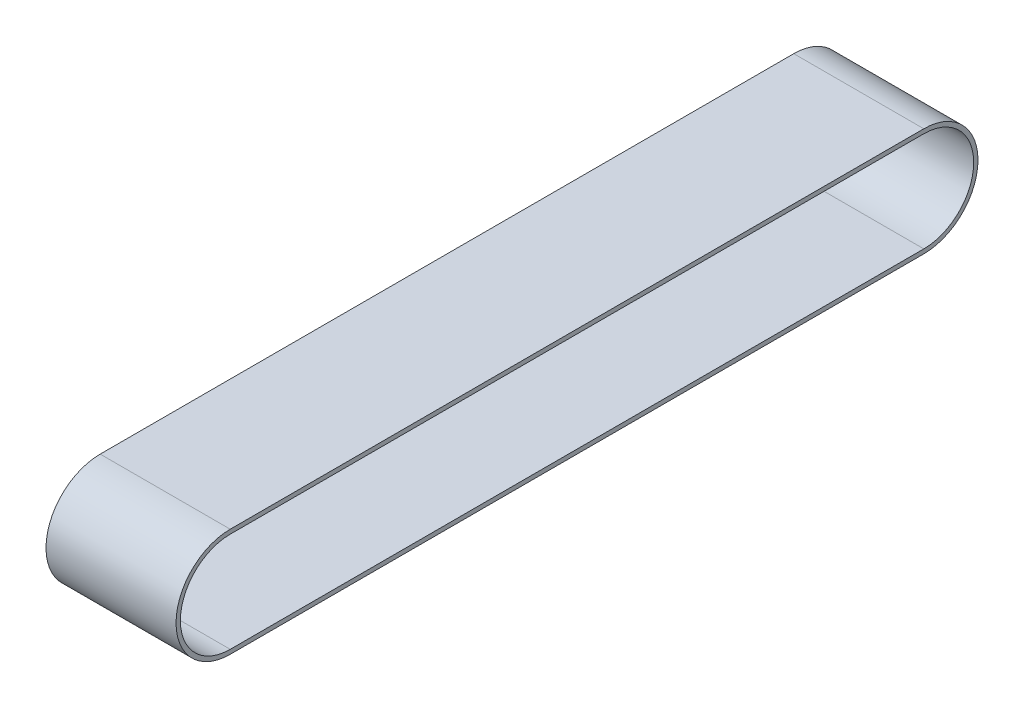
ISO-10303-21;
HEADER;
FILE_DESCRIPTION(('STEP AP214'),'2;1');
FILE_NAME('part.step','',(''),(''),'','','');
FILE_SCHEMA(('AUTOMOTIVE_DESIGN { 1 0 10303 214 1 1 1 1 }'));
ENDSEC;
DATA;
#1=APPLICATION_CONTEXT('core data for automotive mechanical design processes');
#2=APPLICATION_PROTOCOL_DEFINITION('international standard','automotive_design',2000,#1);
#3=PRODUCT_CONTEXT('',#1,'mechanical');
#4=PRODUCT('Part','Part','',(#3));
#5=PRODUCT_RELATED_PRODUCT_CATEGORY('part','',(#4));
#6=PRODUCT_DEFINITION_FORMATION('','',#4);
#7=PRODUCT_DEFINITION_CONTEXT('part definition',#1,'design');
#8=PRODUCT_DEFINITION('design','',#6,#7);
#9=PRODUCT_DEFINITION_SHAPE('','',#8);
#10=(LENGTH_UNIT() NAMED_UNIT(*) SI_UNIT(.MILLI.,.METRE.));
#11=(NAMED_UNIT(*) PLANE_ANGLE_UNIT() SI_UNIT($,.RADIAN.));
#12=(NAMED_UNIT(*) SI_UNIT($,.STERADIAN.) SOLID_ANGLE_UNIT());
#13=UNCERTAINTY_MEASURE_WITH_UNIT(LENGTH_MEASURE(1.E-05),#10,'distance_accuracy_value','');
#14=(GEOMETRIC_REPRESENTATION_CONTEXT(3) GLOBAL_UNCERTAINTY_ASSIGNED_CONTEXT((#13)) GLOBAL_UNIT_ASSIGNED_CONTEXT((#10,
#11,#12)) REPRESENTATION_CONTEXT('',''));
#15=CARTESIAN_POINT('',(0.,0.,0.));
#16=DIRECTION('',(0.,0.,1.));
#17=DIRECTION('',(1.,0.,0.));
#18=AXIS2_PLACEMENT_3D('',#15,#16,#17);
#19=CARTESIAN_POINT('',(60.,25.,0.));
#20=DIRECTION('',(0.,-1.,0.));
#21=DIRECTION('',(0.,0.,-1.));
#22=AXIS2_PLACEMENT_3D('',#19,#20,#21);
#23=PLANE('',#22);
#24=DIRECTION('',(-1.,0.,0.));
#25=VECTOR('',#24,1.);
#26=CARTESIAN_POINT('',(60.,25.,0.));
#27=LINE('',#26,#25);
#28=CARTESIAN_POINT('',(60.,25.,0.));
#29=VERTEX_POINT('',#28);
#30=CARTESIAN_POINT('',(0.,25.,0.));
#31=VERTEX_POINT('',#30);
#32=EDGE_CURVE('E116',#29,#31,#27,.T.);
#33=ORIENTED_EDGE('',*,*,#32,.F.);
#34=DIRECTION('',(0.,0.,-1.));
#35=VECTOR('',#34,1.);
#36=CARTESIAN_POINT('',(60.,25.,0.));
#37=LINE('',#36,#35);
#38=CARTESIAN_POINT('',(60.,25.,-320.));
#39=VERTEX_POINT('',#38);
#40=EDGE_CURVE('E74',#39,#29,#37,.F.);
#41=ORIENTED_EDGE('',*,*,#40,.F.);
#42=DIRECTION('',(-1.,0.,0.));
#43=VECTOR('',#42,1.);
#44=CARTESIAN_POINT('',(60.,25.,-320.));
#45=LINE('',#44,#43);
#46=CARTESIAN_POINT('',(0.,25.,-320.));
#47=VERTEX_POINT('',#46);
#48=EDGE_CURVE('E118',#47,#39,#45,.F.);
#49=ORIENTED_EDGE('',*,*,#48,.F.);
#50=DIRECTION('',(0.,0.,-1.));
#51=VECTOR('',#50,1.);
#52=CARTESIAN_POINT('',(0.,25.,0.));
#53=LINE('',#52,#51);
#54=EDGE_CURVE('E126',#47,#31,#53,.F.);
#55=ORIENTED_EDGE('',*,*,#54,.T.);
#56=EDGE_LOOP('',(#33,#41,#49,#55));
#57=FACE_BOUND('',#56,.T.);
#58=ADVANCED_FACE('F17',(#57),#23,.F.);
#59=CARTESIAN_POINT('',(60.,23.,0.));
#60=DIRECTION('',(0.,-1.,0.));
#61=DIRECTION('',(0.,0.,-1.));
#62=AXIS2_PLACEMENT_3D('',#59,#60,#61);
#63=PLANE('',#62);
#64=DIRECTION('',(0.,0.,-1.));
#65=VECTOR('',#64,1.);
#66=CARTESIAN_POINT('',(60.,23.,0.));
#67=LINE('',#66,#65);
#68=CARTESIAN_POINT('',(60.,23.,0.));
#69=VERTEX_POINT('',#68);
#70=CARTESIAN_POINT('',(60.,23.,-320.));
#71=VERTEX_POINT('',#70);
#72=EDGE_CURVE('E97',#69,#71,#67,.T.);
#73=ORIENTED_EDGE('',*,*,#72,.F.);
#74=DIRECTION('',(-1.,0.,0.));
#75=VECTOR('',#74,1.);
#76=CARTESIAN_POINT('',(60.,23.,0.));
#77=LINE('',#76,#75);
#78=CARTESIAN_POINT('',(0.,23.,0.));
#79=VERTEX_POINT('',#78);
#80=EDGE_CURVE('E79',#69,#79,#77,.T.);
#81=ORIENTED_EDGE('',*,*,#80,.T.);
#82=DIRECTION('',(0.,0.,-1.));
#83=VECTOR('',#82,1.);
#84=CARTESIAN_POINT('',(0.,23.,0.));
#85=LINE('',#84,#83);
#86=CARTESIAN_POINT('',(0.,23.,-320.));
#87=VERTEX_POINT('',#86);
#88=EDGE_CURVE('E124',#79,#87,#85,.T.);
#89=ORIENTED_EDGE('',*,*,#88,.T.);
#90=DIRECTION('',(-1.,0.,0.));
#91=VECTOR('',#90,1.);
#92=CARTESIAN_POINT('',(60.,23.,-320.));
#93=LINE('',#92,#91);
#94=EDGE_CURVE('E113',#87,#71,#93,.F.);
#95=ORIENTED_EDGE('',*,*,#94,.T.);
#96=EDGE_LOOP('',(#73,#81,#89,#95));
#97=FACE_BOUND('',#96,.T.);
#98=ADVANCED_FACE('F137',(#97),#63,.T.);
#99=CARTESIAN_POINT('',(60.,0.,-320.));
#100=DIRECTION('',(-1.,0.,0.));
#101=DIRECTION('',(0.,0.,1.));
#102=AXIS2_PLACEMENT_3D('',#99,#100,#101);
#103=CYLINDRICAL_SURFACE('',#102,23.);
#104=DIRECTION('',(1.,0.,0.));
#105=VECTOR('',#104,1.);
#106=CARTESIAN_POINT('',(60.,-23.,-320.));
#107=LINE('',#106,#105);
#108=CARTESIAN_POINT('',(60.,-23.,-320.));
#109=VERTEX_POINT('',#108);
#110=CARTESIAN_POINT('',(0.,-23.,-320.));
#111=VERTEX_POINT('',#110);
#112=EDGE_CURVE('E110',#109,#111,#107,.F.);
#113=ORIENTED_EDGE('',*,*,#112,.F.);
#114=CARTESIAN_POINT('',(60.,0.,-320.));
#115=DIRECTION('',(-1.,0.,0.));
#116=DIRECTION('',(0.,0.,1.));
#117=AXIS2_PLACEMENT_3D('',#114,#115,#116);
#118=CIRCLE('',#117,23.);
#119=EDGE_CURVE('E99',#71,#109,#118,.T.);
#120=ORIENTED_EDGE('',*,*,#119,.F.);
#121=ORIENTED_EDGE('',*,*,#94,.F.);
#122=CARTESIAN_POINT('',(0.,0.,-320.));
#123=DIRECTION('',(-1.,0.,0.));
#124=DIRECTION('',(0.,0.,1.));
#125=AXIS2_PLACEMENT_3D('',#122,#123,#124);
#126=CIRCLE('',#125,23.);
#127=EDGE_CURVE('E121',#87,#111,#126,.T.);
#128=ORIENTED_EDGE('',*,*,#127,.T.);
#129=EDGE_LOOP('',(#113,#120,#121,#128));
#130=FACE_BOUND('',#129,.T.);
#131=ADVANCED_FACE('F146',(#130),#103,.F.);
#132=CARTESIAN_POINT('',(60.,-23.,0.));
#133=DIRECTION('',(0.,1.,0.));
#134=DIRECTION('',(0.,0.,1.));
#135=AXIS2_PLACEMENT_3D('',#132,#133,#134);
#136=PLANE('',#135);
#137=DIRECTION('',(0.,0.,-1.));
#138=VECTOR('',#137,1.);
#139=CARTESIAN_POINT('',(60.,-23.,0.));
#140=LINE('',#139,#138);
#141=CARTESIAN_POINT('',(60.,-23.,0.));
#142=VERTEX_POINT('',#141);
#143=EDGE_CURVE('E101',#109,#142,#140,.F.);
#144=ORIENTED_EDGE('',*,*,#143,.F.);
#145=ORIENTED_EDGE('',*,*,#112,.T.);
#146=DIRECTION('',(0.,0.,-1.));
#147=VECTOR('',#146,1.);
#148=CARTESIAN_POINT('',(0.,-23.,0.));
#149=LINE('',#148,#147);
#150=CARTESIAN_POINT('',(0.,-23.,0.));
#151=VERTEX_POINT('',#150);
#152=EDGE_CURVE('E93',#111,#151,#149,.F.);
#153=ORIENTED_EDGE('',*,*,#152,.T.);
#154=DIRECTION('',(-1.,0.,0.));
#155=VECTOR('',#154,1.);
#156=CARTESIAN_POINT('',(60.,-23.,0.));
#157=LINE('',#156,#155);
#158=EDGE_CURVE('E107',#151,#142,#157,.F.);
#159=ORIENTED_EDGE('',*,*,#158,.T.);
#160=EDGE_LOOP('',(#144,#145,#153,#159));
#161=FACE_BOUND('',#160,.T.);
#162=ADVANCED_FACE('F148',(#161),#136,.T.);
#163=CARTESIAN_POINT('',(60.,0.,0.));
#164=DIRECTION('',(-1.,0.,0.));
#165=DIRECTION('',(0.,0.,1.));
#166=AXIS2_PLACEMENT_3D('',#163,#164,#165);
#167=CYLINDRICAL_SURFACE('',#166,23.);
#168=CARTESIAN_POINT('',(60.,0.,0.));
#169=DIRECTION('',(-1.,0.,0.));
#170=DIRECTION('',(0.,0.,1.));
#171=AXIS2_PLACEMENT_3D('',#168,#169,#170);
#172=CIRCLE('',#171,23.);
#173=EDGE_CURVE('E100',#142,#69,#172,.T.);
#174=ORIENTED_EDGE('',*,*,#173,.F.);
#175=ORIENTED_EDGE('',*,*,#158,.F.);
#176=CARTESIAN_POINT('',(0.,0.,0.));
#177=DIRECTION('',(-1.,0.,0.));
#178=DIRECTION('',(0.,0.,1.));
#179=AXIS2_PLACEMENT_3D('',#176,#177,#178);
#180=CIRCLE('',#179,23.);
#181=EDGE_CURVE('E90',#151,#79,#180,.T.);
#182=ORIENTED_EDGE('',*,*,#181,.T.);
#183=ORIENTED_EDGE('',*,*,#80,.F.);
#184=EDGE_LOOP('',(#174,#175,#182,#183));
#185=FACE_BOUND('',#184,.T.);
#186=ADVANCED_FACE('F152',(#185),#167,.F.);
#187=CARTESIAN_POINT('',(60.,0.,0.));
#188=DIRECTION('',(-1.,0.,0.));
#189=DIRECTION('',(0.,0.,1.));
#190=AXIS2_PLACEMENT_3D('',#187,#188,#189);
#191=CYLINDRICAL_SURFACE('',#190,25.);
#192=CARTESIAN_POINT('',(0.,0.,0.));
#193=DIRECTION('',(-1.,0.,0.));
#194=DIRECTION('',(0.,0.,1.));
#195=AXIS2_PLACEMENT_3D('',#192,#193,#194);
#196=CIRCLE('',#195,25.);
#197=CARTESIAN_POINT('',(0.,-25.,0.));
#198=VERTEX_POINT('',#197);
#199=EDGE_CURVE('E89',#31,#198,#196,.F.);
#200=ORIENTED_EDGE('',*,*,#199,.T.);
#201=DIRECTION('',(1.,0.,0.));
#202=VECTOR('',#201,1.);
#203=CARTESIAN_POINT('',(60.,-25.,0.));
#204=LINE('',#203,#202);
#205=CARTESIAN_POINT('',(60.,-25.,0.));
#206=VERTEX_POINT('',#205);
#207=EDGE_CURVE('E84',#198,#206,#204,.T.);
#208=ORIENTED_EDGE('',*,*,#207,.T.);
#209=CARTESIAN_POINT('',(60.,0.,0.));
#210=DIRECTION('',(-1.,0.,0.));
#211=DIRECTION('',(0.,0.,1.));
#212=AXIS2_PLACEMENT_3D('',#209,#210,#211);
#213=CIRCLE('',#212,25.);
#214=EDGE_CURVE('E20',#29,#206,#213,.F.);
#215=ORIENTED_EDGE('',*,*,#214,.F.);
#216=ORIENTED_EDGE('',*,*,#32,.T.);
#217=EDGE_LOOP('',(#200,#208,#215,#216));
#218=FACE_BOUND('',#217,.T.);
#219=ADVANCED_FACE('F87',(#218),#191,.T.);
#220=CARTESIAN_POINT('',(60.,0.,0.));
#221=DIRECTION('',(1.,0.,0.));
#222=DIRECTION('',(0.,0.,-1.));
#223=AXIS2_PLACEMENT_3D('',#220,#221,#222);
#224=PLANE('',#223);
#225=ORIENTED_EDGE('',*,*,#72,.T.);
#226=ORIENTED_EDGE('',*,*,#119,.T.);
#227=ORIENTED_EDGE('',*,*,#143,.T.);
#228=ORIENTED_EDGE('',*,*,#173,.T.);
#229=EDGE_LOOP('',(#225,#226,#227,#228));
#230=FACE_BOUND('',#229,.T.);
#231=CARTESIAN_POINT('',(60.,0.,-320.));
#232=DIRECTION('',(-1.,0.,0.));
#233=DIRECTION('',(0.,0.,1.));
#234=AXIS2_PLACEMENT_3D('',#231,#232,#233);
#235=CIRCLE('',#234,25.);
#236=CARTESIAN_POINT('',(60.,-25.,-320.));
#237=VERTEX_POINT('',#236);
#238=EDGE_CURVE('E119',#39,#237,#235,.T.);
#239=ORIENTED_EDGE('',*,*,#238,.F.);
#240=ORIENTED_EDGE('',*,*,#40,.T.);
#241=ORIENTED_EDGE('',*,*,#214,.T.);
#242=DIRECTION('',(0.,0.,1.));
#243=VECTOR('',#242,1.);
#244=CARTESIAN_POINT('',(60.,-25.,0.));
#245=LINE('',#244,#243);
#246=EDGE_CURVE('E72',#206,#237,#245,.F.);
#247=ORIENTED_EDGE('',*,*,#246,.T.);
#248=EDGE_LOOP('',(#239,#240,#241,#247));
#249=FACE_BOUND('',#248,.T.);
#250=ADVANCED_FACE('F71',(#230,#249),#224,.T.);
#251=CARTESIAN_POINT('',(60.,0.,-320.));
#252=DIRECTION('',(-1.,0.,0.));
#253=DIRECTION('',(0.,0.,1.));
#254=AXIS2_PLACEMENT_3D('',#251,#252,#253);
#255=CYLINDRICAL_SURFACE('',#254,25.);
#256=ORIENTED_EDGE('',*,*,#238,.T.);
#257=DIRECTION('',(1.,0.,0.));
#258=VECTOR('',#257,1.);
#259=CARTESIAN_POINT('',(60.,-25.,-320.));
#260=LINE('',#259,#258);
#261=CARTESIAN_POINT('',(0.,-25.,-320.));
#262=VERTEX_POINT('',#261);
#263=EDGE_CURVE('E26',#237,#262,#260,.F.);
#264=ORIENTED_EDGE('',*,*,#263,.T.);
#265=CARTESIAN_POINT('',(0.,0.,-320.));
#266=DIRECTION('',(-1.,0.,0.));
#267=DIRECTION('',(0.,0.,1.));
#268=AXIS2_PLACEMENT_3D('',#265,#266,#267);
#269=CIRCLE('',#268,25.);
#270=EDGE_CURVE('E34',#262,#47,#269,.F.);
#271=ORIENTED_EDGE('',*,*,#270,.T.);
#272=ORIENTED_EDGE('',*,*,#48,.T.);
#273=EDGE_LOOP('',(#256,#264,#271,#272));
#274=FACE_BOUND('',#273,.T.);
#275=ADVANCED_FACE('F165',(#274),#255,.T.);
#276=CARTESIAN_POINT('',(0.,0.,0.));
#277=DIRECTION('',(1.,0.,0.));
#278=DIRECTION('',(0.,0.,-1.));
#279=AXIS2_PLACEMENT_3D('',#276,#277,#278);
#280=PLANE('',#279);
#281=ORIENTED_EDGE('',*,*,#181,.F.);
#282=ORIENTED_EDGE('',*,*,#152,.F.);
#283=ORIENTED_EDGE('',*,*,#127,.F.);
#284=ORIENTED_EDGE('',*,*,#88,.F.);
#285=EDGE_LOOP('',(#281,#282,#283,#284));
#286=FACE_BOUND('',#285,.T.);
#287=ORIENTED_EDGE('',*,*,#54,.F.);
#288=ORIENTED_EDGE('',*,*,#270,.F.);
#289=DIRECTION('',(0.,0.,1.));
#290=VECTOR('',#289,1.);
#291=CARTESIAN_POINT('',(0.,-25.,0.));
#292=LINE('',#291,#290);
#293=EDGE_CURVE('E11',#262,#198,#292,.T.);
#294=ORIENTED_EDGE('',*,*,#293,.T.);
#295=ORIENTED_EDGE('',*,*,#199,.F.);
#296=EDGE_LOOP('',(#287,#288,#294,#295));
#297=FACE_BOUND('',#296,.T.);
#298=ADVANCED_FACE('F160',(#286,#297),#280,.F.);
#299=CARTESIAN_POINT('',(60.,-25.,0.));
#300=DIRECTION('',(0.,1.,0.));
#301=DIRECTION('',(0.,0.,1.));
#302=AXIS2_PLACEMENT_3D('',#299,#300,#301);
#303=PLANE('',#302);
#304=ORIENTED_EDGE('',*,*,#263,.F.);
#305=ORIENTED_EDGE('',*,*,#246,.F.);
#306=ORIENTED_EDGE('',*,*,#207,.F.);
#307=ORIENTED_EDGE('',*,*,#293,.F.);
#308=EDGE_LOOP('',(#304,#305,#306,#307));
#309=FACE_BOUND('',#308,.T.);
#310=ADVANCED_FACE('F83',(#309),#303,.F.);
#311=CLOSED_SHELL('',(#58,#98,#131,#162,#186,#219,#250,#275,#298,#310));
#312=MANIFOLD_SOLID_BREP('B1',#311);
#313=ADVANCED_BREP_SHAPE_REPRESENTATION('',(#18,#312),#14);
#314=SHAPE_DEFINITION_REPRESENTATION(#9,#313);
ENDSEC;
END-ISO-10303-21;
